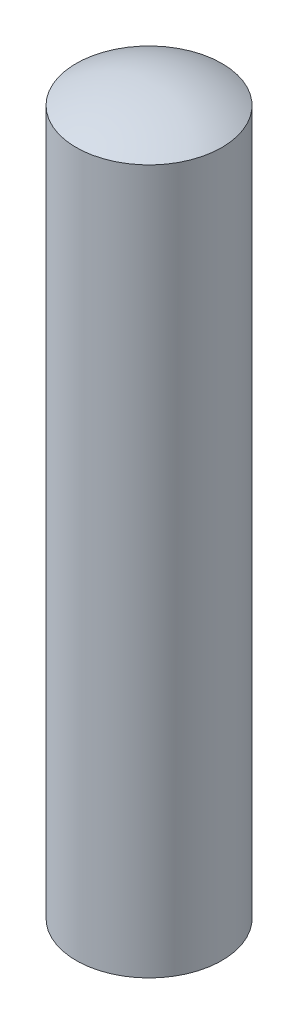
from build123d import *


with BuildPart() as part:
    # Esquisse2 → Base-R_volution (revolve)
    with BuildSketch(Plane.XY, mode=Mode.PRIVATE) as base_r_volution_sk:
        with BuildLine():
            Line((0, -10), (0, 41))
            ThreePointArc((0, 41), (2.588190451, 40.659258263), (5, 39.660254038))
            Line((5, 39.660254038), (5, -8.660254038))
            ThreePointArc((5, -8.660254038), (2.588190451, -9.659258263), (0, -10))
        make_face()
    revolve(base_r_volution_sk.sketch.rotate(Axis((0, -10, 0), (0, 1, 0)), 90), axis=Axis((0, -10, 0), (0, 1, 0)))


solid = part.part
